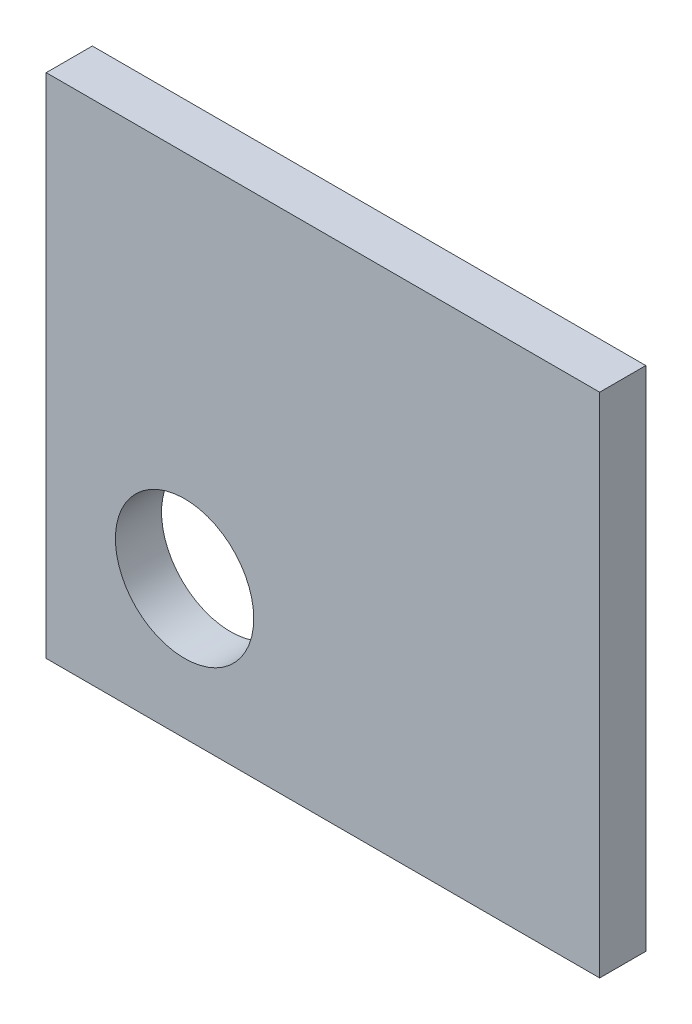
from build123d import *

# Parameters (mm, degrees)
SKETCH1_W      = 76.2
SKETCH1_H      = 69.85
SKETCH1_R      = 9.525
EXTRUDE1_DEPTH = 6.35


with BuildPart() as part:
    # Sketch1 → Extrude1 (new body)
    with BuildSketch(Plane.XY):
        with Locations((38.1, 34.925)):
            Rectangle(SKETCH1_W, SKETCH1_H)
        with Locations((19.05, 19.05)):
            Circle(SKETCH1_R, mode=Mode.SUBTRACT)
    extrude(amount=EXTRUDE1_DEPTH)


solid = part.part
